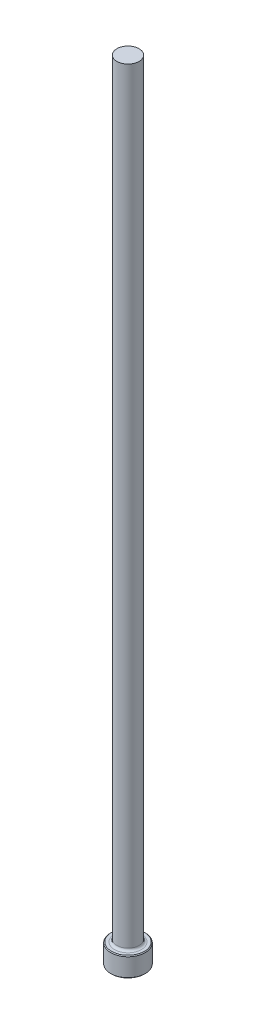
ISO-10303-21;
HEADER;
FILE_DESCRIPTION(('STEP AP214'),'2;1');
FILE_NAME('part.step','',(''),(''),'','','');
FILE_SCHEMA(('AUTOMOTIVE_DESIGN { 1 0 10303 214 1 1 1 1 }'));
ENDSEC;
DATA;
#1=APPLICATION_CONTEXT('core data for automotive mechanical design processes');
#2=APPLICATION_PROTOCOL_DEFINITION('international standard','automotive_design',2000,#1);
#3=PRODUCT_CONTEXT('',#1,'mechanical');
#4=PRODUCT('Part','Part','',(#3));
#5=PRODUCT_RELATED_PRODUCT_CATEGORY('part','',(#4));
#6=PRODUCT_DEFINITION_FORMATION('','',#4);
#7=PRODUCT_DEFINITION_CONTEXT('part definition',#1,'design');
#8=PRODUCT_DEFINITION('design','',#6,#7);
#9=PRODUCT_DEFINITION_SHAPE('','',#8);
#10=(LENGTH_UNIT() NAMED_UNIT(*) SI_UNIT(.MILLI.,.METRE.));
#11=(NAMED_UNIT(*) PLANE_ANGLE_UNIT() SI_UNIT($,.RADIAN.));
#12=(NAMED_UNIT(*) SI_UNIT($,.STERADIAN.) SOLID_ANGLE_UNIT());
#13=UNCERTAINTY_MEASURE_WITH_UNIT(LENGTH_MEASURE(1.E-05),#10,'distance_accuracy_value','');
#14=(GEOMETRIC_REPRESENTATION_CONTEXT(3) GLOBAL_UNCERTAINTY_ASSIGNED_CONTEXT((#13)) GLOBAL_UNIT_ASSIGNED_CONTEXT((#10,
#11,#12)) REPRESENTATION_CONTEXT('',''));
#15=CARTESIAN_POINT('',(0.,0.,0.));
#16=DIRECTION('',(0.,0.,1.));
#17=DIRECTION('',(1.,0.,0.));
#18=AXIS2_PLACEMENT_3D('',#15,#16,#17);
#19=CARTESIAN_POINT('',(0.,0.,0.));
#20=DIRECTION('',(0.,-1.,0.));
#21=DIRECTION('',(0.,0.,-1.));
#22=AXIS2_PLACEMENT_3D('',#19,#20,#21);
#23=PLANE('',#22);
#24=CARTESIAN_POINT('',(0.,0.,0.));
#25=DIRECTION('',(0.,-1.,0.));
#26=DIRECTION('',(0.,0.,-1.));
#27=AXIS2_PLACEMENT_3D('',#24,#25,#26);
#28=CIRCLE('',#27,5.29589999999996);
#29=CARTESIAN_POINT('',(0.,0.,-5.29589999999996));
#30=VERTEX_POINT('',#29);
#31=EDGE_CURVE('E46',#30,#30,#28,.T.);
#32=ORIENTED_EDGE('',*,*,#31,.T.);
#33=EDGE_LOOP('',(#32));
#34=FACE_BOUND('',#33,.T.);
#35=ADVANCED_FACE('F35',(#34),#23,.T.);
#36=CARTESIAN_POINT('',(0.,259.958771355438,0.));
#37=DIRECTION('',(0.,1.,0.));
#38=DIRECTION('',(0.,0.,1.));
#39=AXIS2_PLACEMENT_3D('',#36,#37,#38);
#40=CYLINDRICAL_SURFACE('',#39,5.54989999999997);
#41=CARTESIAN_POINT('',(0.,6.09600000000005,0.));
#42=DIRECTION('',(0.,1.,0.));
#43=DIRECTION('',(0.,0.,1.));
#44=AXIS2_PLACEMENT_3D('',#41,#42,#43);
#45=CIRCLE('',#44,5.54989999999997);
#46=CARTESIAN_POINT('',(0.,6.09600000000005,5.54989999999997));
#47=VERTEX_POINT('',#46);
#48=EDGE_CURVE('E50',#47,#47,#45,.F.);
#49=ORIENTED_EDGE('',*,*,#48,.T.);
#50=EDGE_LOOP('',(#49));
#51=FACE_BOUND('',#50,.T.);
#52=CARTESIAN_POINT('',(0.,0.253999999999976,0.));
#53=DIRECTION('',(0.,-1.,0.));
#54=DIRECTION('',(0.,0.,-1.));
#55=AXIS2_PLACEMENT_3D('',#52,#53,#54);
#56=CIRCLE('',#55,5.54989999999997);
#57=CARTESIAN_POINT('',(0.,0.253999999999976,-5.54989999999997));
#58=VERTEX_POINT('',#57);
#59=EDGE_CURVE('E55',#58,#58,#56,.F.);
#60=ORIENTED_EDGE('',*,*,#59,.T.);
#61=EDGE_LOOP('',(#60));
#62=FACE_BOUND('',#61,.T.);
#63=ADVANCED_FACE('F77',(#51,#62),#40,.T.);
#64=CARTESIAN_POINT('',(-5.54989999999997,6.35,0.));
#65=DIRECTION('',(0.,1.,0.));
#66=DIRECTION('',(0.,0.,1.));
#67=AXIS2_PLACEMENT_3D('',#64,#65,#66);
#68=PLANE('',#67);
#69=CARTESIAN_POINT('',(0.,6.35,0.));
#70=DIRECTION('',(0.,1.,0.));
#71=DIRECTION('',(0.,0.,1.));
#72=AXIS2_PLACEMENT_3D('',#69,#70,#71);
#73=CIRCLE('',#72,4.33323999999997);
#74=CARTESIAN_POINT('',(0.,6.35,4.33323999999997));
#75=VERTEX_POINT('',#74);
#76=EDGE_CURVE('E10',#75,#75,#73,.F.);
#77=ORIENTED_EDGE('',*,*,#76,.T.);
#78=EDGE_LOOP('',(#77));
#79=FACE_BOUND('',#78,.T.);
#80=CARTESIAN_POINT('',(0.,6.35,0.));
#81=DIRECTION('',(0.,1.,0.));
#82=DIRECTION('',(0.,0.,1.));
#83=AXIS2_PLACEMENT_3D('',#80,#81,#82);
#84=CIRCLE('',#83,5.29590000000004);
#85=CARTESIAN_POINT('',(0.,6.35,5.29590000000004));
#86=VERTEX_POINT('',#85);
#87=EDGE_CURVE('E58',#86,#86,#84,.T.);
#88=ORIENTED_EDGE('',*,*,#87,.T.);
#89=EDGE_LOOP('',(#88));
#90=FACE_BOUND('',#89,.T.);
#91=ADVANCED_FACE('F69',(#79,#90),#68,.T.);
#92=CARTESIAN_POINT('',(0.,259.958771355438,0.));
#93=DIRECTION('',(0.,1.,0.));
#94=DIRECTION('',(0.,0.,1.));
#95=AXIS2_PLACEMENT_3D('',#92,#93,#94);
#96=CYLINDRICAL_SURFACE('',#95,3.57123999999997);
#97=CARTESIAN_POINT('',(0.,7.11200000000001,0.));
#98=DIRECTION('',(0.,1.,0.));
#99=DIRECTION('',(0.,0.,1.));
#100=AXIS2_PLACEMENT_3D('',#97,#98,#99);
#101=CIRCLE('',#100,3.57123999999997);
#102=CARTESIAN_POINT('',(0.,7.11200000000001,3.57123999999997));
#103=VERTEX_POINT('',#102);
#104=EDGE_CURVE('E42',#103,#103,#101,.T.);
#105=ORIENTED_EDGE('',*,*,#104,.T.);
#106=EDGE_LOOP('',(#105));
#107=FACE_BOUND('',#106,.T.);
#108=CARTESIAN_POINT('',(0.,254.,0.));
#109=DIRECTION('',(0.,1.,0.));
#110=DIRECTION('',(0.,0.,1.));
#111=AXIS2_PLACEMENT_3D('',#108,#109,#110);
#112=CIRCLE('',#111,3.57123999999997);
#113=CARTESIAN_POINT('',(0.,254.,3.57123999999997));
#114=VERTEX_POINT('',#113);
#115=EDGE_CURVE('E61',#114,#114,#112,.T.);
#116=ORIENTED_EDGE('',*,*,#115,.F.);
#117=EDGE_LOOP('',(#116));
#118=FACE_BOUND('',#117,.T.);
#119=ADVANCED_FACE('F67',(#107,#118),#96,.T.);
#120=CARTESIAN_POINT('',(-3.57123999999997,254.,0.));
#121=DIRECTION('',(0.,1.,0.));
#122=DIRECTION('',(0.,0.,1.));
#123=AXIS2_PLACEMENT_3D('',#120,#121,#122);
#124=PLANE('',#123);
#125=ORIENTED_EDGE('',*,*,#115,.T.);
#126=EDGE_LOOP('',(#125));
#127=FACE_BOUND('',#126,.T.);
#128=ADVANCED_FACE('F65',(#127),#124,.T.);
#129=CARTESIAN_POINT('',(0.,6.35000000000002,0.));
#130=DIRECTION('',(0.,-1.,0.));
#131=DIRECTION('',(0.,0.,-1.));
#132=AXIS2_PLACEMENT_3D('',#129,#130,#131);
#133=CONICAL_SURFACE('',#132,5.29590000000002,0.785398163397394);
#134=ORIENTED_EDGE('',*,*,#48,.F.);
#135=EDGE_LOOP('',(#134));
#136=FACE_BOUND('',#135,.T.);
#137=ORIENTED_EDGE('',*,*,#87,.F.);
#138=EDGE_LOOP('',(#137));
#139=FACE_BOUND('',#138,.T.);
#140=ADVANCED_FACE('F75',(#136,#139),#133,.T.);
#141=CARTESIAN_POINT('',(0.,0.253999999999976,0.));
#142=DIRECTION('',(0.,1.,0.));
#143=DIRECTION('',(0.,0.,1.));
#144=AXIS2_PLACEMENT_3D('',#141,#142,#143);
#145=CONICAL_SURFACE('',#144,5.54989999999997,0.785398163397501);
#146=ORIENTED_EDGE('',*,*,#31,.F.);
#147=EDGE_LOOP('',(#146));
#148=FACE_BOUND('',#147,.T.);
#149=ORIENTED_EDGE('',*,*,#59,.F.);
#150=EDGE_LOOP('',(#149));
#151=FACE_BOUND('',#150,.T.);
#152=ADVANCED_FACE('F89',(#148,#151),#145,.T.);
#153=CARTESIAN_POINT('',(0.,7.11200000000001,0.));
#154=DIRECTION('',(0.,1.,0.));
#155=DIRECTION('',(0.,0.,1.));
#156=AXIS2_PLACEMENT_3D('',#153,#154,#155);
#157=TOROIDAL_SURFACE('',#156,4.33323999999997,0.762);
#158=ORIENTED_EDGE('',*,*,#76,.F.);
#159=EDGE_LOOP('',(#158));
#160=FACE_BOUND('',#159,.T.);
#161=ORIENTED_EDGE('',*,*,#104,.F.);
#162=EDGE_LOOP('',(#161));
#163=FACE_BOUND('',#162,.T.);
#164=ADVANCED_FACE('F37',(#160,#163),#157,.F.);
#165=CLOSED_SHELL('',(#35,#63,#91,#119,#128,#140,#152,#164));
#166=MANIFOLD_SOLID_BREP('B2',#165);
#167=ADVANCED_BREP_SHAPE_REPRESENTATION('',(#18,#166),#14);
#168=SHAPE_DEFINITION_REPRESENTATION(#9,#167);
ENDSEC;
END-ISO-10303-21;
